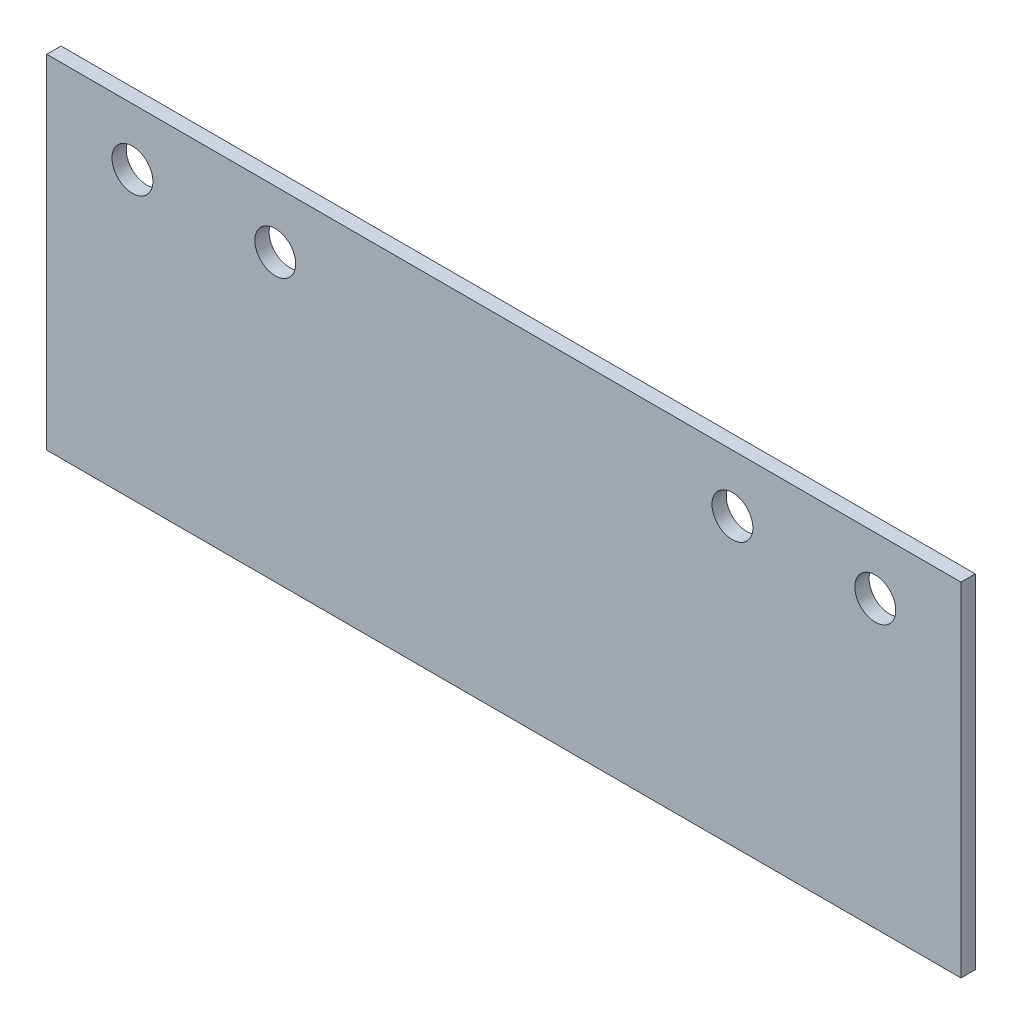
ISO-10303-21;
HEADER;
FILE_DESCRIPTION(('STEP AP214'),'2;1');
FILE_NAME('part.step','',(''),(''),'','','');
FILE_SCHEMA(('AUTOMOTIVE_DESIGN { 1 0 10303 214 1 1 1 1 }'));
ENDSEC;
DATA;
#1=APPLICATION_CONTEXT('core data for automotive mechanical design processes');
#2=APPLICATION_PROTOCOL_DEFINITION('international standard','automotive_design',2000,#1);
#3=PRODUCT_CONTEXT('',#1,'mechanical');
#4=PRODUCT('Part','Part','',(#3));
#5=PRODUCT_RELATED_PRODUCT_CATEGORY('part','',(#4));
#6=PRODUCT_DEFINITION_FORMATION('','',#4);
#7=PRODUCT_DEFINITION_CONTEXT('part definition',#1,'design');
#8=PRODUCT_DEFINITION('design','',#6,#7);
#9=PRODUCT_DEFINITION_SHAPE('','',#8);
#10=(LENGTH_UNIT() NAMED_UNIT(*) SI_UNIT(.MILLI.,.METRE.));
#11=(NAMED_UNIT(*) PLANE_ANGLE_UNIT() SI_UNIT($,.RADIAN.));
#12=(NAMED_UNIT(*) SI_UNIT($,.STERADIAN.) SOLID_ANGLE_UNIT());
#13=UNCERTAINTY_MEASURE_WITH_UNIT(LENGTH_MEASURE(1.E-05),#10,'distance_accuracy_value','');
#14=(GEOMETRIC_REPRESENTATION_CONTEXT(3) GLOBAL_UNCERTAINTY_ASSIGNED_CONTEXT((#13)) GLOBAL_UNIT_ASSIGNED_CONTEXT((#10,
#11,#12)) REPRESENTATION_CONTEXT('',''));
#15=CARTESIAN_POINT('',(0.,0.,0.));
#16=DIRECTION('',(0.,0.,1.));
#17=DIRECTION('',(1.,0.,0.));
#18=AXIS2_PLACEMENT_3D('',#15,#16,#17);
#19=CARTESIAN_POINT('',(203.2,0.,3.175));
#20=DIRECTION('',(-1.,0.,0.));
#21=DIRECTION('',(0.,0.,1.));
#22=AXIS2_PLACEMENT_3D('',#19,#20,#21);
#23=PLANE('',#22);
#24=DIRECTION('',(0.,1.,0.));
#25=VECTOR('',#24,1.);
#26=CARTESIAN_POINT('',(203.2,0.,0.));
#27=LINE('',#26,#25);
#28=CARTESIAN_POINT('',(203.2,0.,0.));
#29=VERTEX_POINT('',#28);
#30=CARTESIAN_POINT('',(203.2,76.2,0.));
#31=VERTEX_POINT('',#30);
#32=EDGE_CURVE('E95',#29,#31,#27,.T.);
#33=ORIENTED_EDGE('',*,*,#32,.T.);
#34=DIRECTION('',(0.,0.,-1.));
#35=VECTOR('',#34,1.);
#36=CARTESIAN_POINT('',(203.2,76.2,3.175));
#37=LINE('',#36,#35);
#38=CARTESIAN_POINT('',(203.2,76.2,3.175));
#39=VERTEX_POINT('',#38);
#40=EDGE_CURVE('E11',#39,#31,#37,.T.);
#41=ORIENTED_EDGE('',*,*,#40,.F.);
#42=DIRECTION('',(0.,1.,0.));
#43=VECTOR('',#42,1.);
#44=CARTESIAN_POINT('',(203.2,0.,3.175));
#45=LINE('',#44,#43);
#46=CARTESIAN_POINT('',(203.2,0.,3.175));
#47=VERTEX_POINT('',#46);
#48=EDGE_CURVE('E83',#47,#39,#45,.T.);
#49=ORIENTED_EDGE('',*,*,#48,.F.);
#50=DIRECTION('',(0.,0.,-1.));
#51=VECTOR('',#50,1.);
#52=CARTESIAN_POINT('',(203.2,0.,3.175));
#53=LINE('',#52,#51);
#54=EDGE_CURVE('E91',#47,#29,#53,.T.);
#55=ORIENTED_EDGE('',*,*,#54,.T.);
#56=EDGE_LOOP('',(#33,#41,#49,#55));
#57=FACE_BOUND('',#56,.T.);
#58=ADVANCED_FACE('F32',(#57),#23,.F.);
#59=CARTESIAN_POINT('',(203.2,76.2,3.175));
#60=DIRECTION('',(0.,-1.,0.));
#61=DIRECTION('',(1.,0.,0.));
#62=AXIS2_PLACEMENT_3D('',#59,#60,#61);
#63=PLANE('',#62);
#64=DIRECTION('',(-1.,0.,0.));
#65=VECTOR('',#64,1.);
#66=CARTESIAN_POINT('',(203.2,76.2,0.));
#67=LINE('',#66,#65);
#68=CARTESIAN_POINT('',(0.,76.2,0.));
#69=VERTEX_POINT('',#68);
#70=EDGE_CURVE('E87',#31,#69,#67,.T.);
#71=ORIENTED_EDGE('',*,*,#70,.T.);
#72=DIRECTION('',(0.,0.,-1.));
#73=VECTOR('',#72,1.);
#74=CARTESIAN_POINT('',(0.,76.2,3.175));
#75=LINE('',#74,#73);
#76=CARTESIAN_POINT('',(0.,76.2,3.175));
#77=VERTEX_POINT('',#76);
#78=EDGE_CURVE('E40',#77,#69,#75,.T.);
#79=ORIENTED_EDGE('',*,*,#78,.F.);
#80=DIRECTION('',(-1.,0.,0.));
#81=VECTOR('',#80,1.);
#82=CARTESIAN_POINT('',(203.2,76.2,3.175));
#83=LINE('',#82,#81);
#84=EDGE_CURVE('E78',#39,#77,#83,.T.);
#85=ORIENTED_EDGE('',*,*,#84,.F.);
#86=ORIENTED_EDGE('',*,*,#40,.T.);
#87=EDGE_LOOP('',(#71,#79,#85,#86));
#88=FACE_BOUND('',#87,.T.);
#89=ADVANCED_FACE('F86',(#88),#63,.F.);
#90=CARTESIAN_POINT('',(0.,0.,3.175));
#91=DIRECTION('',(1.,0.,0.));
#92=DIRECTION('',(0.,0.,-1.));
#93=AXIS2_PLACEMENT_3D('',#90,#91,#92);
#94=PLANE('',#93);
#95=DIRECTION('',(0.,-1.,0.));
#96=VECTOR('',#95,1.);
#97=CARTESIAN_POINT('',(0.,0.,0.));
#98=LINE('',#97,#96);
#99=CARTESIAN_POINT('',(0.,0.,0.));
#100=VERTEX_POINT('',#99);
#101=EDGE_CURVE('E65',#69,#100,#98,.T.);
#102=ORIENTED_EDGE('',*,*,#101,.T.);
#103=DIRECTION('',(0.,0.,-1.));
#104=VECTOR('',#103,1.);
#105=CARTESIAN_POINT('',(0.,0.,3.175));
#106=LINE('',#105,#104);
#107=CARTESIAN_POINT('',(0.,0.,3.175));
#108=VERTEX_POINT('',#107);
#109=EDGE_CURVE('E88',#108,#100,#106,.T.);
#110=ORIENTED_EDGE('',*,*,#109,.F.);
#111=DIRECTION('',(0.,-1.,0.));
#112=VECTOR('',#111,1.);
#113=CARTESIAN_POINT('',(0.,0.,3.175));
#114=LINE('',#113,#112);
#115=EDGE_CURVE('E81',#77,#108,#114,.T.);
#116=ORIENTED_EDGE('',*,*,#115,.F.);
#117=ORIENTED_EDGE('',*,*,#78,.T.);
#118=EDGE_LOOP('',(#102,#110,#116,#117));
#119=FACE_BOUND('',#118,.T.);
#120=ADVANCED_FACE('F89',(#119),#94,.F.);
#121=CARTESIAN_POINT('',(203.2,0.,3.175));
#122=DIRECTION('',(0.,1.,0.));
#123=DIRECTION('',(0.,0.,1.));
#124=AXIS2_PLACEMENT_3D('',#121,#122,#123);
#125=PLANE('',#124);
#126=DIRECTION('',(1.,0.,0.));
#127=VECTOR('',#126,1.);
#128=CARTESIAN_POINT('',(203.2,0.,0.));
#129=LINE('',#128,#127);
#130=EDGE_CURVE('E71',#100,#29,#129,.T.);
#131=ORIENTED_EDGE('',*,*,#130,.T.);
#132=ORIENTED_EDGE('',*,*,#54,.F.);
#133=DIRECTION('',(1.,0.,0.));
#134=VECTOR('',#133,1.);
#135=CARTESIAN_POINT('',(203.2,0.,3.175));
#136=LINE('',#135,#134);
#137=EDGE_CURVE('E48',#108,#47,#136,.T.);
#138=ORIENTED_EDGE('',*,*,#137,.F.);
#139=ORIENTED_EDGE('',*,*,#109,.T.);
#140=EDGE_LOOP('',(#131,#132,#138,#139));
#141=FACE_BOUND('',#140,.T.);
#142=ADVANCED_FACE('F103',(#141),#125,.F.);
#143=CARTESIAN_POINT('',(0.,0.,3.175));
#144=DIRECTION('',(0.,0.,1.));
#145=DIRECTION('',(1.,0.,0.));
#146=AXIS2_PLACEMENT_3D('',#143,#144,#145);
#147=PLANE('',#146);
#148=CARTESIAN_POINT('',(184.15,63.5,3.175));
#149=DIRECTION('',(0.,0.,1.));
#150=DIRECTION('',(1.,0.,0.));
#151=AXIS2_PLACEMENT_3D('',#148,#149,#150);
#152=CIRCLE('',#151,4.54660000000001);
#153=CARTESIAN_POINT('',(188.6966,63.5,3.175));
#154=VERTEX_POINT('',#153);
#155=EDGE_CURVE('E129',#154,#154,#152,.T.);
#156=ORIENTED_EDGE('',*,*,#155,.F.);
#157=EDGE_LOOP('',(#156));
#158=FACE_BOUND('',#157,.T.);
#159=CARTESIAN_POINT('',(19.05,63.5,3.175));
#160=DIRECTION('',(0.,0.,1.));
#161=DIRECTION('',(1.,0.,0.));
#162=AXIS2_PLACEMENT_3D('',#159,#160,#161);
#163=CIRCLE('',#162,4.5466);
#164=CARTESIAN_POINT('',(23.5966,63.5,3.175));
#165=VERTEX_POINT('',#164);
#166=EDGE_CURVE('E123',#165,#165,#163,.T.);
#167=ORIENTED_EDGE('',*,*,#166,.F.);
#168=EDGE_LOOP('',(#167));
#169=FACE_BOUND('',#168,.T.);
#170=CARTESIAN_POINT('',(152.4,63.5,3.175));
#171=DIRECTION('',(0.,0.,1.));
#172=DIRECTION('',(1.,0.,0.));
#173=AXIS2_PLACEMENT_3D('',#170,#171,#172);
#174=CIRCLE('',#173,4.54660000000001);
#175=CARTESIAN_POINT('',(156.9466,63.5,3.175));
#176=VERTEX_POINT('',#175);
#177=EDGE_CURVE('E117',#176,#176,#174,.T.);
#178=ORIENTED_EDGE('',*,*,#177,.F.);
#179=EDGE_LOOP('',(#178));
#180=FACE_BOUND('',#179,.T.);
#181=CARTESIAN_POINT('',(50.8,63.5,3.175));
#182=DIRECTION('',(0.,0.,1.));
#183=DIRECTION('',(1.,0.,0.));
#184=AXIS2_PLACEMENT_3D('',#181,#182,#183);
#185=CIRCLE('',#184,4.5466);
#186=CARTESIAN_POINT('',(55.3466,63.5,3.175));
#187=VERTEX_POINT('',#186);
#188=EDGE_CURVE('E111',#187,#187,#185,.T.);
#189=ORIENTED_EDGE('',*,*,#188,.F.);
#190=EDGE_LOOP('',(#189));
#191=FACE_BOUND('',#190,.T.);
#192=ORIENTED_EDGE('',*,*,#48,.T.);
#193=ORIENTED_EDGE('',*,*,#84,.T.);
#194=ORIENTED_EDGE('',*,*,#115,.T.);
#195=ORIENTED_EDGE('',*,*,#137,.T.);
#196=EDGE_LOOP('',(#192,#193,#194,#195));
#197=FACE_BOUND('',#196,.T.);
#198=ADVANCED_FACE('F79',(#158,#169,#180,#191,#197),#147,.T.);
#199=CARTESIAN_POINT('',(0.,0.,0.));
#200=DIRECTION('',(0.,0.,1.));
#201=DIRECTION('',(1.,0.,0.));
#202=AXIS2_PLACEMENT_3D('',#199,#200,#201);
#203=PLANE('',#202);
#204=CARTESIAN_POINT('',(184.15,63.5,0.));
#205=DIRECTION('',(0.,0.,1.));
#206=DIRECTION('',(1.,0.,0.));
#207=AXIS2_PLACEMENT_3D('',#204,#205,#206);
#208=CIRCLE('',#207,4.54660000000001);
#209=CARTESIAN_POINT('',(188.6966,63.5,0.));
#210=VERTEX_POINT('',#209);
#211=EDGE_CURVE('E126',#210,#210,#208,.T.);
#212=ORIENTED_EDGE('',*,*,#211,.T.);
#213=EDGE_LOOP('',(#212));
#214=FACE_BOUND('',#213,.T.);
#215=CARTESIAN_POINT('',(19.05,63.5,0.));
#216=DIRECTION('',(0.,0.,1.));
#217=DIRECTION('',(1.,0.,0.));
#218=AXIS2_PLACEMENT_3D('',#215,#216,#217);
#219=CIRCLE('',#218,4.5466);
#220=CARTESIAN_POINT('',(23.5966,63.5,0.));
#221=VERTEX_POINT('',#220);
#222=EDGE_CURVE('E120',#221,#221,#219,.T.);
#223=ORIENTED_EDGE('',*,*,#222,.T.);
#224=EDGE_LOOP('',(#223));
#225=FACE_BOUND('',#224,.T.);
#226=CARTESIAN_POINT('',(152.4,63.5,0.));
#227=DIRECTION('',(0.,0.,1.));
#228=DIRECTION('',(1.,0.,0.));
#229=AXIS2_PLACEMENT_3D('',#226,#227,#228);
#230=CIRCLE('',#229,4.54660000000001);
#231=CARTESIAN_POINT('',(156.9466,63.5,0.));
#232=VERTEX_POINT('',#231);
#233=EDGE_CURVE('E114',#232,#232,#230,.T.);
#234=ORIENTED_EDGE('',*,*,#233,.T.);
#235=EDGE_LOOP('',(#234));
#236=FACE_BOUND('',#235,.T.);
#237=CARTESIAN_POINT('',(50.8,63.5,0.));
#238=DIRECTION('',(0.,0.,1.));
#239=DIRECTION('',(1.,0.,0.));
#240=AXIS2_PLACEMENT_3D('',#237,#238,#239);
#241=CIRCLE('',#240,4.5466);
#242=CARTESIAN_POINT('',(55.3466,63.5,0.));
#243=VERTEX_POINT('',#242);
#244=EDGE_CURVE('E98',#243,#243,#241,.T.);
#245=ORIENTED_EDGE('',*,*,#244,.T.);
#246=EDGE_LOOP('',(#245));
#247=FACE_BOUND('',#246,.T.);
#248=ORIENTED_EDGE('',*,*,#32,.F.);
#249=ORIENTED_EDGE('',*,*,#130,.F.);
#250=ORIENTED_EDGE('',*,*,#101,.F.);
#251=ORIENTED_EDGE('',*,*,#70,.F.);
#252=EDGE_LOOP('',(#248,#249,#250,#251));
#253=FACE_BOUND('',#252,.T.);
#254=ADVANCED_FACE('F106',(#214,#225,#236,#247,#253),#203,.F.);
#255=CARTESIAN_POINT('',(50.8,63.5,3.175));
#256=DIRECTION('',(0.,0.,1.));
#257=DIRECTION('',(1.,0.,0.));
#258=AXIS2_PLACEMENT_3D('',#255,#256,#257);
#259=CYLINDRICAL_SURFACE('',#258,4.5466);
#260=ORIENTED_EDGE('',*,*,#244,.F.);
#261=EDGE_LOOP('',(#260));
#262=FACE_BOUND('',#261,.T.);
#263=ORIENTED_EDGE('',*,*,#188,.T.);
#264=EDGE_LOOP('',(#263));
#265=FACE_BOUND('',#264,.T.);
#266=ADVANCED_FACE('F144',(#262,#265),#259,.F.);
#267=CARTESIAN_POINT('',(152.4,63.5,3.175));
#268=DIRECTION('',(0.,0.,1.));
#269=DIRECTION('',(1.,0.,0.));
#270=AXIS2_PLACEMENT_3D('',#267,#268,#269);
#271=CYLINDRICAL_SURFACE('',#270,4.54660000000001);
#272=ORIENTED_EDGE('',*,*,#233,.F.);
#273=EDGE_LOOP('',(#272));
#274=FACE_BOUND('',#273,.T.);
#275=ORIENTED_EDGE('',*,*,#177,.T.);
#276=EDGE_LOOP('',(#275));
#277=FACE_BOUND('',#276,.T.);
#278=ADVANCED_FACE('F146',(#274,#277),#271,.F.);
#279=CARTESIAN_POINT('',(19.05,63.5,3.175));
#280=DIRECTION('',(0.,0.,1.));
#281=DIRECTION('',(1.,0.,0.));
#282=AXIS2_PLACEMENT_3D('',#279,#280,#281);
#283=CYLINDRICAL_SURFACE('',#282,4.5466);
#284=ORIENTED_EDGE('',*,*,#222,.F.);
#285=EDGE_LOOP('',(#284));
#286=FACE_BOUND('',#285,.T.);
#287=ORIENTED_EDGE('',*,*,#166,.T.);
#288=EDGE_LOOP('',(#287));
#289=FACE_BOUND('',#288,.T.);
#290=ADVANCED_FACE('F153',(#286,#289),#283,.F.);
#291=CARTESIAN_POINT('',(184.15,63.5,3.175));
#292=DIRECTION('',(0.,0.,1.));
#293=DIRECTION('',(1.,0.,0.));
#294=AXIS2_PLACEMENT_3D('',#291,#292,#293);
#295=CYLINDRICAL_SURFACE('',#294,4.54660000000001);
#296=ORIENTED_EDGE('',*,*,#211,.F.);
#297=EDGE_LOOP('',(#296));
#298=FACE_BOUND('',#297,.T.);
#299=ORIENTED_EDGE('',*,*,#155,.T.);
#300=EDGE_LOOP('',(#299));
#301=FACE_BOUND('',#300,.T.);
#302=ADVANCED_FACE('F133',(#298,#301),#295,.F.);
#303=CLOSED_SHELL('',(#58,#89,#120,#142,#198,#254,#266,#278,#290,#302));
#304=MANIFOLD_SOLID_BREP('B2',#303);
#305=ADVANCED_BREP_SHAPE_REPRESENTATION('',(#18,#304),#14);
#306=SHAPE_DEFINITION_REPRESENTATION(#9,#305);
ENDSEC;
END-ISO-10303-21;
